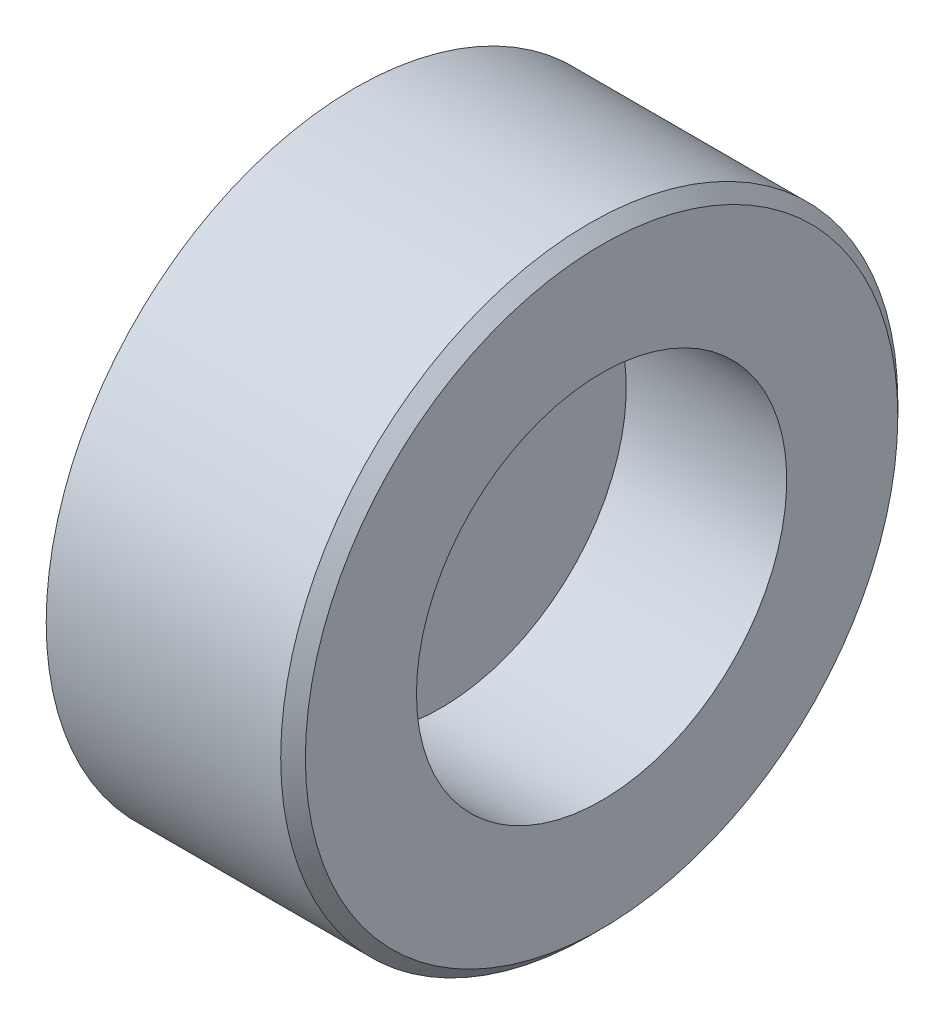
ISO-10303-21;
HEADER;
FILE_DESCRIPTION(('STEP AP214'),'2;1');
FILE_NAME('part.step','',(''),(''),'','','');
FILE_SCHEMA(('AUTOMOTIVE_DESIGN { 1 0 10303 214 1 1 1 1 }'));
ENDSEC;
DATA;
#1=APPLICATION_CONTEXT('core data for automotive mechanical design processes');
#2=APPLICATION_PROTOCOL_DEFINITION('international standard','automotive_design',2000,#1);
#3=PRODUCT_CONTEXT('',#1,'mechanical');
#4=PRODUCT('Part','Part','',(#3));
#5=PRODUCT_RELATED_PRODUCT_CATEGORY('part','',(#4));
#6=PRODUCT_DEFINITION_FORMATION('','',#4);
#7=PRODUCT_DEFINITION_CONTEXT('part definition',#1,'design');
#8=PRODUCT_DEFINITION('design','',#6,#7);
#9=PRODUCT_DEFINITION_SHAPE('','',#8);
#10=(LENGTH_UNIT() NAMED_UNIT(*) SI_UNIT(.MILLI.,.METRE.));
#11=(NAMED_UNIT(*) PLANE_ANGLE_UNIT() SI_UNIT($,.RADIAN.));
#12=(NAMED_UNIT(*) SI_UNIT($,.STERADIAN.) SOLID_ANGLE_UNIT());
#13=UNCERTAINTY_MEASURE_WITH_UNIT(LENGTH_MEASURE(1.E-05),#10,'distance_accuracy_value','');
#14=(GEOMETRIC_REPRESENTATION_CONTEXT(3) GLOBAL_UNCERTAINTY_ASSIGNED_CONTEXT((#13)) GLOBAL_UNIT_ASSIGNED_CONTEXT((#10,
#11,#12)) REPRESENTATION_CONTEXT('',''));
#15=CARTESIAN_POINT('',(0.,0.,0.));
#16=DIRECTION('',(0.,0.,1.));
#17=DIRECTION('',(1.,0.,0.));
#18=AXIS2_PLACEMENT_3D('',#15,#16,#17);
#19=CARTESIAN_POINT('',(0.,0.,0.));
#20=DIRECTION('',(1.,0.,0.));
#21=DIRECTION('',(0.,0.,-1.));
#22=AXIS2_PLACEMENT_3D('',#19,#20,#21);
#23=PLANE('',#22);
#24=CARTESIAN_POINT('',(0.,-0.14,0.));
#25=DIRECTION('',(-1.,0.,0.));
#26=DIRECTION('',(0.,0.,1.));
#27=AXIS2_PLACEMENT_3D('',#24,#25,#26);
#28=CIRCLE('',#27,0.0656249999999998);
#29=CARTESIAN_POINT('',(0.,-0.14,0.0656249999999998));
#30=VERTEX_POINT('',#29);
#31=EDGE_CURVE('E68',#30,#30,#28,.T.);
#32=ORIENTED_EDGE('',*,*,#31,.F.);
#33=EDGE_LOOP('',(#32));
#34=FACE_BOUND('',#33,.T.);
#35=CARTESIAN_POINT('',(0.,0.14,0.));
#36=DIRECTION('',(-1.,0.,0.));
#37=DIRECTION('',(0.,0.,1.));
#38=AXIS2_PLACEMENT_3D('',#35,#36,#37);
#39=CIRCLE('',#38,0.0656249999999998);
#40=CARTESIAN_POINT('',(0.,0.14,0.0656249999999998));
#41=VERTEX_POINT('',#40);
#42=EDGE_CURVE('E65',#41,#41,#39,.T.);
#43=ORIENTED_EDGE('',*,*,#42,.F.);
#44=EDGE_LOOP('',(#43));
#45=FACE_BOUND('',#44,.T.);
#46=CARTESIAN_POINT('',(0.,0.,0.));
#47=DIRECTION('',(-1.,0.,0.));
#48=DIRECTION('',(0.,0.,1.));
#49=AXIS2_PLACEMENT_3D('',#46,#47,#48);
#50=CIRCLE('',#49,2.5);
#51=CARTESIAN_POINT('',(0.,0.,2.5));
#52=VERTEX_POINT('',#51);
#53=EDGE_CURVE('E56',#52,#52,#50,.T.);
#54=ORIENTED_EDGE('',*,*,#53,.T.);
#55=EDGE_LOOP('',(#54));
#56=FACE_BOUND('',#55,.T.);
#57=ADVANCED_FACE('F30',(#34,#45,#56),#23,.F.);
#58=CARTESIAN_POINT('',(0.,0.,0.));
#59=DIRECTION('',(-1.,0.,0.));
#60=DIRECTION('',(0.,0.,1.));
#61=AXIS2_PLACEMENT_3D('',#58,#59,#60);
#62=CYLINDRICAL_SURFACE('',#61,2.5);
#63=CARTESIAN_POINT('',(1.9,0.,0.));
#64=DIRECTION('',(-1.,0.,0.));
#65=DIRECTION('',(0.,0.,1.));
#66=AXIS2_PLACEMENT_3D('',#63,#64,#65);
#67=CIRCLE('',#66,2.5);
#68=CARTESIAN_POINT('',(1.9,0.,2.5));
#69=VERTEX_POINT('',#68);
#70=EDGE_CURVE('E37',#69,#69,#67,.T.);
#71=ORIENTED_EDGE('',*,*,#70,.T.);
#72=EDGE_LOOP('',(#71));
#73=FACE_BOUND('',#72,.T.);
#74=ORIENTED_EDGE('',*,*,#53,.F.);
#75=EDGE_LOOP('',(#74));
#76=FACE_BOUND('',#75,.T.);
#77=ADVANCED_FACE('F76',(#73,#76),#62,.T.);
#78=CARTESIAN_POINT('',(2.,2.5,0.));
#79=DIRECTION('',(-1.,0.,0.));
#80=DIRECTION('',(0.,0.,1.));
#81=AXIS2_PLACEMENT_3D('',#78,#79,#80);
#82=PLANE('',#81);
#83=CARTESIAN_POINT('',(2.,0.,0.));
#84=DIRECTION('',(-1.,0.,0.));
#85=DIRECTION('',(0.,0.,1.));
#86=AXIS2_PLACEMENT_3D('',#83,#84,#85);
#87=CIRCLE('',#86,2.4);
#88=CARTESIAN_POINT('',(2.,0.,2.4));
#89=VERTEX_POINT('',#88);
#90=EDGE_CURVE('E10',#89,#89,#87,.F.);
#91=ORIENTED_EDGE('',*,*,#90,.T.);
#92=EDGE_LOOP('',(#91));
#93=FACE_BOUND('',#92,.T.);
#94=CARTESIAN_POINT('',(2.,0.,0.));
#95=DIRECTION('',(-1.,0.,0.));
#96=DIRECTION('',(0.,0.,1.));
#97=AXIS2_PLACEMENT_3D('',#94,#95,#96);
#98=CIRCLE('',#97,1.5);
#99=CARTESIAN_POINT('',(2.,0.,1.5));
#100=VERTEX_POINT('',#99);
#101=EDGE_CURVE('E59',#100,#100,#98,.T.);
#102=ORIENTED_EDGE('',*,*,#101,.T.);
#103=EDGE_LOOP('',(#102));
#104=FACE_BOUND('',#103,.T.);
#105=ADVANCED_FACE('F83',(#93,#104),#82,.F.);
#106=CARTESIAN_POINT('',(0.,0.,0.));
#107=DIRECTION('',(-1.,0.,0.));
#108=DIRECTION('',(0.,0.,1.));
#109=AXIS2_PLACEMENT_3D('',#106,#107,#108);
#110=CYLINDRICAL_SURFACE('',#109,1.5);
#111=ORIENTED_EDGE('',*,*,#101,.F.);
#112=EDGE_LOOP('',(#111));
#113=FACE_BOUND('',#112,.T.);
#114=CARTESIAN_POINT('',(0.7,0.,0.));
#115=DIRECTION('',(-1.,0.,0.));
#116=DIRECTION('',(0.,0.,1.));
#117=AXIS2_PLACEMENT_3D('',#114,#115,#116);
#118=CIRCLE('',#117,1.5);
#119=CARTESIAN_POINT('',(0.7,0.,1.5));
#120=VERTEX_POINT('',#119);
#121=EDGE_CURVE('E62',#120,#120,#118,.T.);
#122=ORIENTED_EDGE('',*,*,#121,.T.);
#123=EDGE_LOOP('',(#122));
#124=FACE_BOUND('',#123,.T.);
#125=ADVANCED_FACE('F88',(#113,#124),#110,.F.);
#126=CARTESIAN_POINT('',(0.7,1.5,0.));
#127=DIRECTION('',(-1.,0.,0.));
#128=DIRECTION('',(0.,0.,1.));
#129=AXIS2_PLACEMENT_3D('',#126,#127,#128);
#130=PLANE('',#129);
#131=CARTESIAN_POINT('',(0.7,0.14,0.));
#132=DIRECTION('',(-1.,0.,0.));
#133=DIRECTION('',(0.,0.,1.));
#134=AXIS2_PLACEMENT_3D('',#131,#132,#133);
#135=CIRCLE('',#134,0.115624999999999);
#136=CARTESIAN_POINT('',(0.7,0.14,0.115624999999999));
#137=VERTEX_POINT('',#136);
#138=EDGE_CURVE('E50',#137,#137,#135,.T.);
#139=ORIENTED_EDGE('',*,*,#138,.T.);
#140=EDGE_LOOP('',(#139));
#141=FACE_BOUND('',#140,.T.);
#142=CARTESIAN_POINT('',(0.7,-0.14,0.));
#143=DIRECTION('',(-1.,0.,0.));
#144=DIRECTION('',(0.,0.,1.));
#145=AXIS2_PLACEMENT_3D('',#142,#143,#144);
#146=CIRCLE('',#145,0.115624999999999);
#147=CARTESIAN_POINT('',(0.7,-0.14,0.115624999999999));
#148=VERTEX_POINT('',#147);
#149=EDGE_CURVE('E53',#148,#148,#146,.T.);
#150=ORIENTED_EDGE('',*,*,#149,.T.);
#151=EDGE_LOOP('',(#150));
#152=FACE_BOUND('',#151,.T.);
#153=ORIENTED_EDGE('',*,*,#121,.F.);
#154=EDGE_LOOP('',(#153));
#155=FACE_BOUND('',#154,.T.);
#156=ADVANCED_FACE('F106',(#141,#152,#155),#130,.F.);
#157=CARTESIAN_POINT('',(0.,0.14,0.));
#158=DIRECTION('',(-1.,0.,0.));
#159=DIRECTION('',(0.,0.,1.));
#160=AXIS2_PLACEMENT_3D('',#157,#158,#159);
#161=CYLINDRICAL_SURFACE('',#160,0.0656249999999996);
#162=CARTESIAN_POINT('',(0.650000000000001,0.14,0.));
#163=DIRECTION('',(-1.,0.,0.));
#164=DIRECTION('',(0.,0.,1.));
#165=AXIS2_PLACEMENT_3D('',#162,#163,#164);
#166=CIRCLE('',#165,0.0656249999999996);
#167=CARTESIAN_POINT('',(0.650000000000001,0.14,0.0656249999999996));
#168=VERTEX_POINT('',#167);
#169=EDGE_CURVE('E45',#168,#168,#166,.F.);
#170=ORIENTED_EDGE('',*,*,#169,.T.);
#171=EDGE_LOOP('',(#170));
#172=FACE_BOUND('',#171,.T.);
#173=ORIENTED_EDGE('',*,*,#42,.T.);
#174=EDGE_LOOP('',(#173));
#175=FACE_BOUND('',#174,.T.);
#176=ADVANCED_FACE('F109',(#172,#175),#161,.F.);
#177=CARTESIAN_POINT('',(0.,-0.14,0.));
#178=DIRECTION('',(-1.,0.,0.));
#179=DIRECTION('',(0.,0.,1.));
#180=AXIS2_PLACEMENT_3D('',#177,#178,#179);
#181=CYLINDRICAL_SURFACE('',#180,0.0656249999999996);
#182=CARTESIAN_POINT('',(0.650000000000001,-0.14,0.));
#183=DIRECTION('',(-1.,0.,0.));
#184=DIRECTION('',(0.,0.,1.));
#185=AXIS2_PLACEMENT_3D('',#182,#183,#184);
#186=CIRCLE('',#185,0.0656249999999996);
#187=CARTESIAN_POINT('',(0.650000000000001,-0.14,0.0656249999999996));
#188=VERTEX_POINT('',#187);
#189=EDGE_CURVE('E41',#188,#188,#186,.F.);
#190=ORIENTED_EDGE('',*,*,#189,.T.);
#191=EDGE_LOOP('',(#190));
#192=FACE_BOUND('',#191,.T.);
#193=ORIENTED_EDGE('',*,*,#31,.T.);
#194=EDGE_LOOP('',(#193));
#195=FACE_BOUND('',#194,.T.);
#196=ADVANCED_FACE('F72',(#192,#195),#181,.F.);
#197=CARTESIAN_POINT('',(0.7,0.14,0.));
#198=DIRECTION('',(1.,0.,0.));
#199=DIRECTION('',(0.,0.,-1.));
#200=AXIS2_PLACEMENT_3D('',#197,#198,#199);
#201=CONICAL_SURFACE('',#200,0.115624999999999,0.785398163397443);
#202=ORIENTED_EDGE('',*,*,#169,.F.);
#203=EDGE_LOOP('',(#202));
#204=FACE_BOUND('',#203,.T.);
#205=ORIENTED_EDGE('',*,*,#138,.F.);
#206=EDGE_LOOP('',(#205));
#207=FACE_BOUND('',#206,.T.);
#208=ADVANCED_FACE('F92',(#204,#207),#201,.F.);
#209=CARTESIAN_POINT('',(0.7,-0.14,0.));
#210=DIRECTION('',(1.,0.,0.));
#211=DIRECTION('',(0.,0.,-1.));
#212=AXIS2_PLACEMENT_3D('',#209,#210,#211);
#213=CONICAL_SURFACE('',#212,0.115624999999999,0.785398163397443);
#214=ORIENTED_EDGE('',*,*,#189,.F.);
#215=EDGE_LOOP('',(#214));
#216=FACE_BOUND('',#215,.T.);
#217=ORIENTED_EDGE('',*,*,#149,.F.);
#218=EDGE_LOOP('',(#217));
#219=FACE_BOUND('',#218,.T.);
#220=ADVANCED_FACE('F94',(#216,#219),#213,.F.);
#221=CARTESIAN_POINT('',(1.9,0.,0.));
#222=DIRECTION('',(-1.,0.,0.));
#223=DIRECTION('',(0.,0.,1.));
#224=AXIS2_PLACEMENT_3D('',#221,#222,#223);
#225=CONICAL_SURFACE('',#224,2.5,0.785398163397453);
#226=CARTESIAN_POINT('',(2.,0.,2.4));
#227=CARTESIAN_POINT('',(1.99895833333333,0.,2.40104166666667));
#228=CARTESIAN_POINT('',(1.99791666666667,0.,2.40208333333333));
#229=CARTESIAN_POINT('',(1.99583333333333,0.,2.40416666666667));
#230=CARTESIAN_POINT('',(1.99479166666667,0.,2.40520833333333));
#231=CARTESIAN_POINT('',(1.99270833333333,0.,2.40729166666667));
#232=CARTESIAN_POINT('',(1.99166666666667,0.,2.40833333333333));
#233=CARTESIAN_POINT('',(1.98958333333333,0.,2.41041666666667));
#234=CARTESIAN_POINT('',(1.98854166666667,0.,2.41145833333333));
#235=CARTESIAN_POINT('',(1.98645833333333,0.,2.41354166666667));
#236=CARTESIAN_POINT('',(1.98541666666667,0.,2.41458333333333));
#237=CARTESIAN_POINT('',(1.98333333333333,0.,2.41666666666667));
#238=CARTESIAN_POINT('',(1.98229166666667,0.,2.41770833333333));
#239=CARTESIAN_POINT('',(1.98020833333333,0.,2.41979166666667));
#240=CARTESIAN_POINT('',(1.97916666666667,0.,2.42083333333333));
#241=CARTESIAN_POINT('',(1.97708333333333,0.,2.42291666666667));
#242=CARTESIAN_POINT('',(1.97604166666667,0.,2.42395833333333));
#243=CARTESIAN_POINT('',(1.97395833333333,0.,2.42604166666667));
#244=CARTESIAN_POINT('',(1.97291666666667,0.,2.42708333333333));
#245=CARTESIAN_POINT('',(1.97083333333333,0.,2.42916666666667));
#246=CARTESIAN_POINT('',(1.96979166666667,0.,2.43020833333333));
#247=CARTESIAN_POINT('',(1.96770833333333,0.,2.43229166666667));
#248=CARTESIAN_POINT('',(1.96666666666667,0.,2.43333333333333));
#249=CARTESIAN_POINT('',(1.96458333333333,0.,2.43541666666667));
#250=CARTESIAN_POINT('',(1.96354166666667,0.,2.43645833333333));
#251=CARTESIAN_POINT('',(1.96145833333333,0.,2.43854166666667));
#252=CARTESIAN_POINT('',(1.96041666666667,0.,2.43958333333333));
#253=CARTESIAN_POINT('',(1.95833333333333,0.,2.44166666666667));
#254=CARTESIAN_POINT('',(1.95729166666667,0.,2.44270833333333));
#255=CARTESIAN_POINT('',(1.95520833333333,0.,2.44479166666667));
#256=CARTESIAN_POINT('',(1.95416666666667,0.,2.44583333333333));
#257=CARTESIAN_POINT('',(1.95208333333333,0.,2.44791666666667));
#258=CARTESIAN_POINT('',(1.95104166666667,0.,2.44895833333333));
#259=CARTESIAN_POINT('',(1.94895833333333,0.,2.45104166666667));
#260=CARTESIAN_POINT('',(1.94791666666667,0.,2.45208333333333));
#261=CARTESIAN_POINT('',(1.94583333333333,0.,2.45416666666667));
#262=CARTESIAN_POINT('',(1.94479166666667,0.,2.45520833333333));
#263=CARTESIAN_POINT('',(1.94270833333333,0.,2.45729166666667));
#264=CARTESIAN_POINT('',(1.94166666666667,0.,2.45833333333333));
#265=CARTESIAN_POINT('',(1.93958333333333,0.,2.46041666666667));
#266=CARTESIAN_POINT('',(1.93854166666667,0.,2.46145833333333));
#267=CARTESIAN_POINT('',(1.93645833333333,0.,2.46354166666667));
#268=CARTESIAN_POINT('',(1.93541666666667,0.,2.46458333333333));
#269=CARTESIAN_POINT('',(1.93333333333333,0.,2.46666666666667));
#270=CARTESIAN_POINT('',(1.93229166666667,0.,2.46770833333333));
#271=CARTESIAN_POINT('',(1.93020833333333,0.,2.46979166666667));
#272=CARTESIAN_POINT('',(1.92916666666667,0.,2.47083333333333));
#273=CARTESIAN_POINT('',(1.92708333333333,0.,2.47291666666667));
#274=CARTESIAN_POINT('',(1.92604166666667,0.,2.47395833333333));
#275=CARTESIAN_POINT('',(1.92395833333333,0.,2.47604166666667));
#276=CARTESIAN_POINT('',(1.92291666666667,0.,2.47708333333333));
#277=CARTESIAN_POINT('',(1.92083333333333,0.,2.47916666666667));
#278=CARTESIAN_POINT('',(1.91979166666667,0.,2.48020833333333));
#279=CARTESIAN_POINT('',(1.91770833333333,0.,2.48229166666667));
#280=CARTESIAN_POINT('',(1.91666666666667,0.,2.48333333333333));
#281=CARTESIAN_POINT('',(1.91458333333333,0.,2.48541666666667));
#282=CARTESIAN_POINT('',(1.91354166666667,0.,2.48645833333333));
#283=CARTESIAN_POINT('',(1.91145833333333,0.,2.48854166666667));
#284=CARTESIAN_POINT('',(1.91041666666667,0.,2.48958333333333));
#285=CARTESIAN_POINT('',(1.90833333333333,0.,2.49166666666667));
#286=CARTESIAN_POINT('',(1.90729166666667,0.,2.49270833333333));
#287=CARTESIAN_POINT('',(1.90520833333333,0.,2.49479166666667));
#288=CARTESIAN_POINT('',(1.90416666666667,0.,2.49583333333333));
#289=CARTESIAN_POINT('',(1.90208333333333,0.,2.49791666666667));
#290=CARTESIAN_POINT('',(1.90104166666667,0.,2.49895833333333));
#291=CARTESIAN_POINT('',(1.9,0.,2.5));
#292=B_SPLINE_CURVE_WITH_KNOTS('',3,(#226,#227,#228,#229,#230,#231,#232,#233,#234,#235,#236,
#237,#238,#239,#240,#241,#242,#243,#244,#245,#246,#247,#248,#249,#250,#251,#252,#253,#254,#255,
#256,#257,#258,#259,#260,#261,#262,#263,#264,#265,#266,#267,#268,#269,#270,#271,#272,#273,#274,
#275,#276,#277,#278,#279,#280,#281,#282,#283,#284,#285,#286,#287,#288,#289,#290,#291),
.UNSPECIFIED.,.F.,.F.,(4,2,2,2,2,2,2,2,2,2,2,2,2,2,2,2,2,2,2,2,2,2,2,2,2,2,2,2,2,2,2,2,4),(0.,
0.00441941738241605,0.0088388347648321,0.0132582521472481,0.0176776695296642,0.0220970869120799,
0.026516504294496,0.0309359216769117,0.0353553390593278,0.0397747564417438,0.0441941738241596,
0.0486135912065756,0.0530330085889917,0.0574524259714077,0.0618718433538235,0.0662912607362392,
0.0707106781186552,0.0751300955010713,0.0795495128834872,0.0839689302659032,0.088388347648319,
0.0928077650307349,0.0972271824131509,0.101646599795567,0.106066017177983,0.110485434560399,
0.114904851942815,0.119324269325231,0.123743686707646,0.128163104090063,0.132582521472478,
0.137001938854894,0.14142135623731),.UNSPECIFIED.);
#293=EDGE_CURVE('BSEAM32',#89,#69,#292,.T.);
#294=ORIENTED_EDGE('',*,*,#90,.F.);
#295=ORIENTED_EDGE('',*,*,#70,.F.);
#296=ORIENTED_EDGE('',*,*,#293,.T.);
#297=ORIENTED_EDGE('',*,*,#293,.F.);
#298=EDGE_LOOP('',(#294,#296,#295,#297));
#299=FACE_BOUND('',#298,.T.);
#300=ADVANCED_FACE('F32',(#299),#225,.T.);
#301=CLOSED_SHELL('',(#57,#77,#105,#125,#156,#176,#196,#208,#220,#300));
#302=MANIFOLD_SOLID_BREP('B2',#301);
#303=ADVANCED_BREP_SHAPE_REPRESENTATION('',(#18,#302),#14);
#304=SHAPE_DEFINITION_REPRESENTATION(#9,#303);
ENDSEC;
END-ISO-10303-21;
